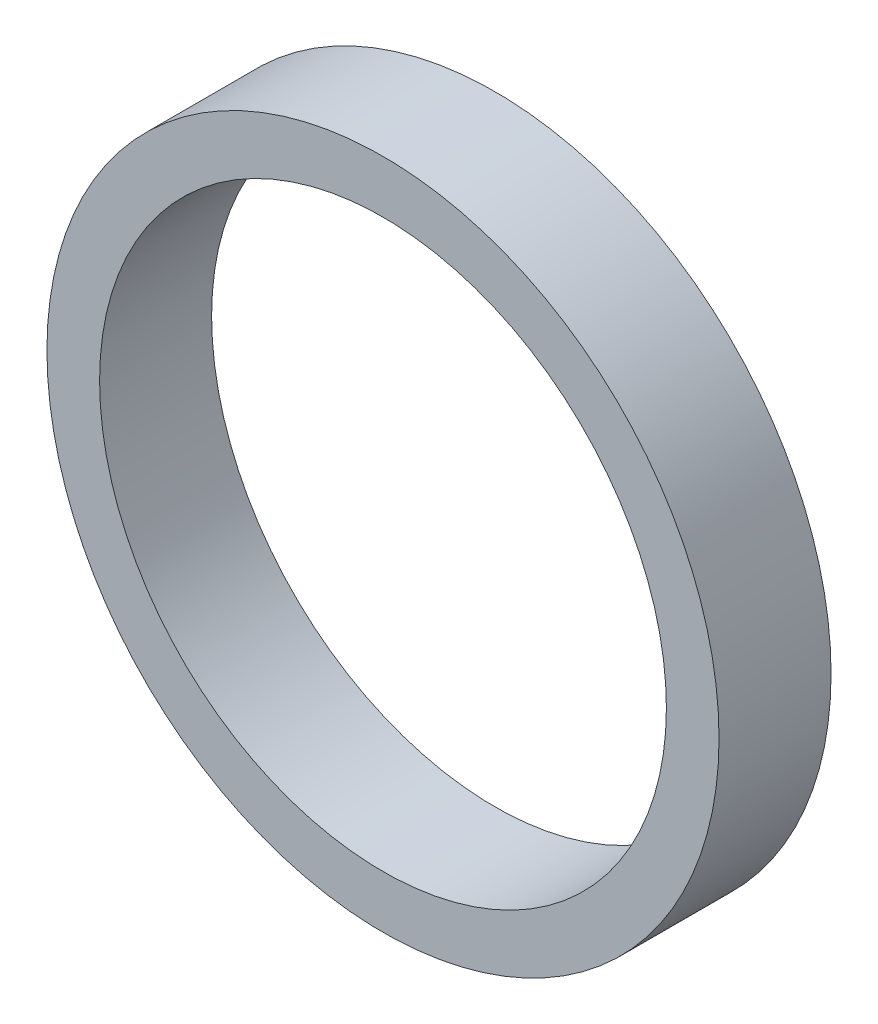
from build123d import *

# Parameters (mm, degrees)
SKETCH1_R      = 19.05
SKETCH1_R_2    = 16.0655
EXTRUDE1_DEPTH = 6.35


with BuildPart() as part:
    # Sketch1 → Extrude1 (new body)
    with BuildSketch(Plane.XY):
        Circle(SKETCH1_R)
        Circle(SKETCH1_R_2, mode=Mode.SUBTRACT)
    extrude(amount=EXTRUDE1_DEPTH)


solid = part.part
